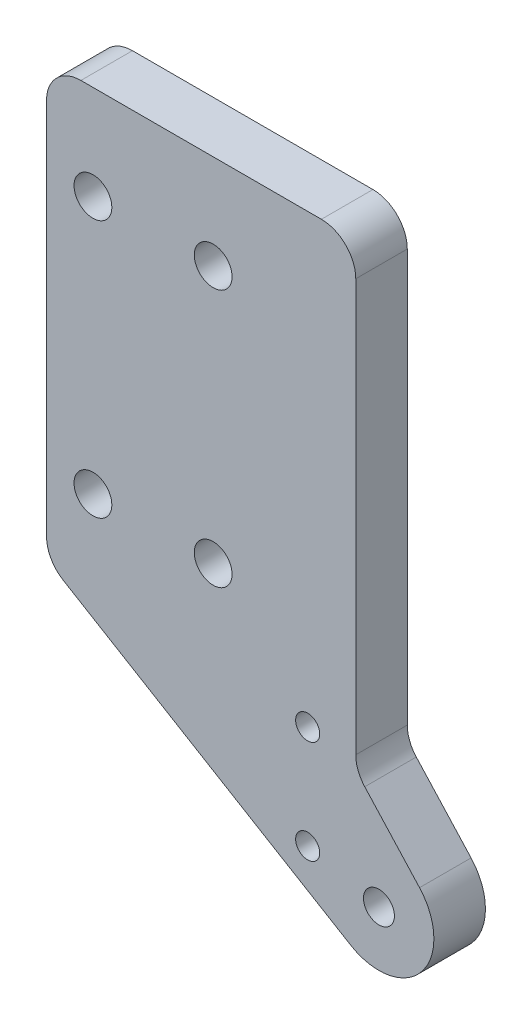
from build123d import *

# Parameters (mm, degrees)
ESQUISSE1_R                     = 29.5
BOSS_EXTRU_1_DEPTH              = 5
BOSS_EXTRU_2_DEPTH              = 15
CHANFREIN1_SIZE                 = 2
ESQUISSE3_R                     = 5.5
ENL_V_MAT_EXTRU_1_DEPTH         = 15
R_P_TITION_LIN_AIRE1_COUNT      = 2
R_P_TITION_LIN_AIRE1_PITCH      = 35
R_P_TITION_LIN_AIRE1_COUNT_DIR2 = 2
R_P_TITION_LIN_AIRE1_PITCH_DIR2 = 75
ESQUISSE4_R                     = 4.5
ENL_V_MAT_EXTRU_2_DEPTH         = 15
ESQUISSE5_R                     = 3.5
ENL_V_MAT_EXTRU_3_DEPTH         = 15
R_P_TITION_LIN_AIRE2_COUNT      = 2
R_P_TITION_LIN_AIRE2_PITCH      = 30


with BuildPart() as part:
    # Esquisse1 → Boss.-Extru.1 (new body)
    with BuildSketch(Plane.XY):
        Circle(ESQUISSE1_R)
    extrude(amount=BOSS_EXTRU_1_DEPTH)

    # Esquisse2 → Boss.-Extru.2 (add)
    with BuildSketch(Plane.XY.offset(5)):
        with BuildLine():
            Line((47.615285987, -71.742847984), (63.565542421, -89.211443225))
            ThreePointArc((63.565542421, -89.211443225), (64.136880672, -110.127447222), (43.524444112, -113.723710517))
            Line((43.524444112, -113.723710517), (-40.14097243, -63.577319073))
            ThreePointArc((-40.14097243, -63.577319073), (-43.700854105, -59.929009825), (-45, -55))
            Line((-45, -55), (-45, 55))
            ThreePointArc((-45, 55), (-42.071067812, 62.071067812), (-35, 65))
            Line((-35, 65), (35, 65))
            ThreePointArc((35, 65), (42.071067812, 62.071067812), (45, 55))
            Line((45, 55), (45, -65))
            ThreePointArc((45, -65), (45.676718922, -68.616134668), (47.615285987, -71.742847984))
        make_face()
    extrude(amount=BOSS_EXTRU_2_DEPTH)

    # Chanfrein1
    chanfrein1_edges = [part.edges().sort_by_distance(p)[0] for p in [
        (-29.5, 0, 0),
    ]]
    chamfer(chanfrein1_edges, length=CHANFREIN1_SIZE)

    # Esquisse3 → Enl_v. mat.-Extru.1 (cut)
    with BuildSketch(Plane.XY.offset(20)):
        with Locations((-31.5, -37.5)):
            Circle(ESQUISSE3_R)
    enl_v_mat_extru_1 = extrude(amount=-ENL_V_MAT_EXTRU_1_DEPTH, mode=Mode.SUBTRACT)

    # R_p_tition lin_aire1: Enl_v. mat.-Extru.1 2 × 2
    with Locations(*[(i * R_P_TITION_LIN_AIRE1_PITCH, j * R_P_TITION_LIN_AIRE1_PITCH_DIR2, 0) for i in range(R_P_TITION_LIN_AIRE1_COUNT) for j in range(R_P_TITION_LIN_AIRE1_COUNT_DIR2) if (i, j) != (0, 0)]):
        add(enl_v_mat_extru_1, mode=Mode.SUBTRACT)

    # Esquisse4 → Enl_v. mat.-Extru.2 (cut)
    with BuildSketch(Plane.XY.offset(20)):
        with Locations((51.75, -100)):
            Circle(ESQUISSE4_R)
    extrude(amount=-ENL_V_MAT_EXTRU_2_DEPTH, mode=Mode.SUBTRACT)

    # Esquisse5 → Enl_v. mat.-Extru.3 (cut)
    with BuildSketch(Plane.XY.offset(20)):
        with Locations((31, -65)):
            Circle(ESQUISSE5_R)
    enl_v_mat_extru_3 = extrude(amount=-ENL_V_MAT_EXTRU_3_DEPTH, mode=Mode.SUBTRACT)

    # R_p_tition lin_aire2: Enl_v. mat.-Extru.3 ×2
    with Locations(*[(0, -i * R_P_TITION_LIN_AIRE2_PITCH, 0) for i in range(1, R_P_TITION_LIN_AIRE2_COUNT)]):
        add(enl_v_mat_extru_3, mode=Mode.SUBTRACT)


solid = part.part
